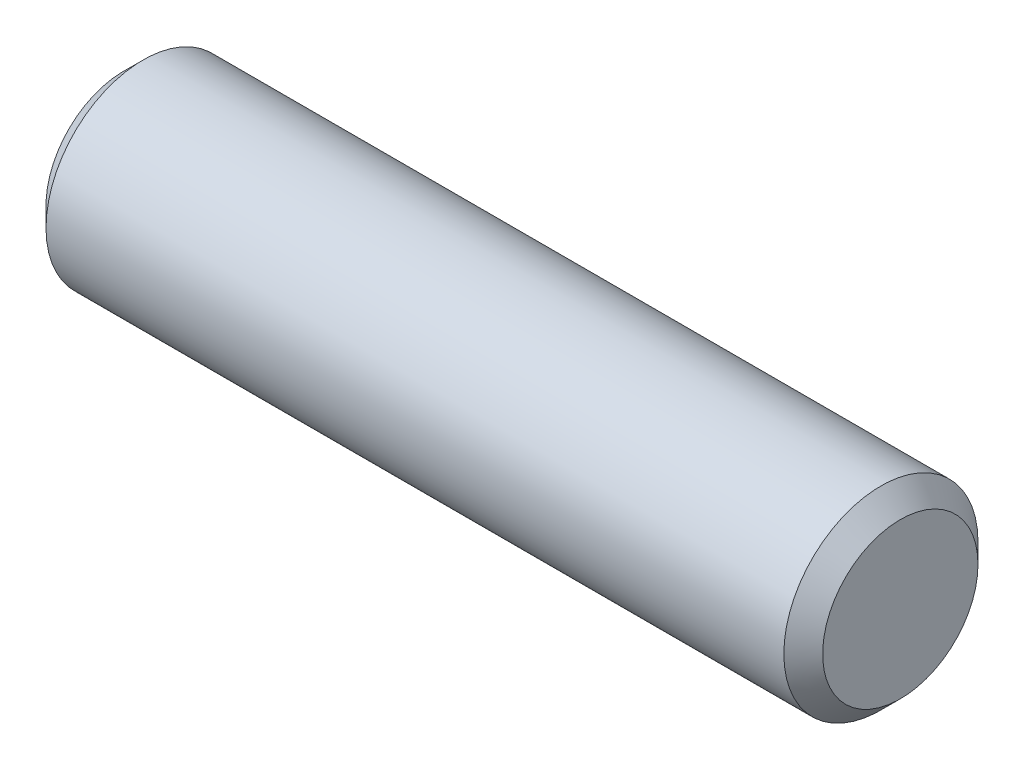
from build123d import *

# Parameters (mm, degrees)
EXTRUDE1_DEPTH      = 12.7
EXTRUDE1_DEPTH_BACK = 12.7
SKETCH2_R           = 3.175
CHAMFER1_SIZE       = 0.635


with BuildPart() as part:
    # Sketch2 → Extrude1 (new, two sides: drawn at the far end of the back side and taken through both)
    with BuildSketch(Plane(origin=(0, 0, 0), x_dir=(0, 0, -1), z_dir=(1, 0, 0)).offset(-EXTRUDE1_DEPTH_BACK)):
        Circle(SKETCH2_R)
    extrude(amount=EXTRUDE1_DEPTH + EXTRUDE1_DEPTH_BACK)

    # Chamfer1
    chamfer1_edges = [part.edges().sort_by_distance(p)[0] for p in [
        (-12.7, 0, 3.175),
        (12.7, 0, 3.175),
    ]]
    chamfer(chamfer1_edges, length=CHAMFER1_SIZE)


solid = part.part
